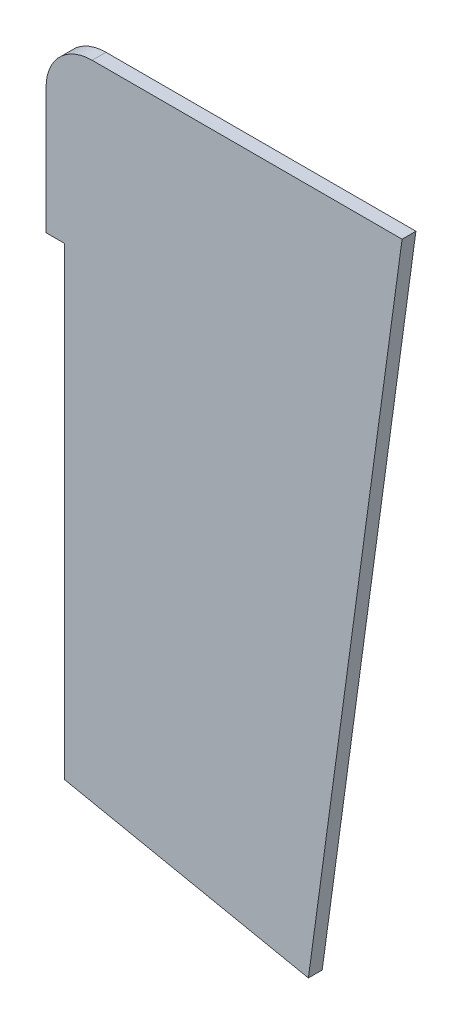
ISO-10303-21;
HEADER;
FILE_DESCRIPTION(('STEP AP214'),'2;1');
FILE_NAME('part.step','',(''),(''),'','','');
FILE_SCHEMA(('AUTOMOTIVE_DESIGN { 1 0 10303 214 1 1 1 1 }'));
ENDSEC;
DATA;
#1=APPLICATION_CONTEXT('core data for automotive mechanical design processes');
#2=APPLICATION_PROTOCOL_DEFINITION('international standard','automotive_design',2000,#1);
#3=PRODUCT_CONTEXT('',#1,'mechanical');
#4=PRODUCT('Part','Part','',(#3));
#5=PRODUCT_RELATED_PRODUCT_CATEGORY('part','',(#4));
#6=PRODUCT_DEFINITION_FORMATION('','',#4);
#7=PRODUCT_DEFINITION_CONTEXT('part definition',#1,'design');
#8=PRODUCT_DEFINITION('design','',#6,#7);
#9=PRODUCT_DEFINITION_SHAPE('','',#8);
#10=(LENGTH_UNIT() NAMED_UNIT(*) SI_UNIT(.MILLI.,.METRE.));
#11=(NAMED_UNIT(*) PLANE_ANGLE_UNIT() SI_UNIT($,.RADIAN.));
#12=(NAMED_UNIT(*) SI_UNIT($,.STERADIAN.) SOLID_ANGLE_UNIT());
#13=UNCERTAINTY_MEASURE_WITH_UNIT(LENGTH_MEASURE(1.E-05),#10,'distance_accuracy_value','');
#14=(GEOMETRIC_REPRESENTATION_CONTEXT(3) GLOBAL_UNCERTAINTY_ASSIGNED_CONTEXT((#13)) GLOBAL_UNIT_ASSIGNED_CONTEXT((#10,
#11,#12)) REPRESENTATION_CONTEXT('',''));
#15=CARTESIAN_POINT('',(0.,0.,0.));
#16=DIRECTION('',(0.,0.,1.));
#17=DIRECTION('',(1.,0.,0.));
#18=AXIS2_PLACEMENT_3D('',#15,#16,#17);
#19=CARTESIAN_POINT('',(236.744667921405,297.979893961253,-3.));
#20=DIRECTION('',(-0.200467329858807,-0.979700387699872,0.));
#21=DIRECTION('',(0.979700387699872,-0.200467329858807,0.));
#22=AXIS2_PLACEMENT_3D('',#19,#20,#21);
#23=PLANE('',#22);
#24=DIRECTION('',(0.979700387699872,-0.200467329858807,0.));
#25=VECTOR('',#24,1.);
#26=CARTESIAN_POINT('',(236.744667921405,297.979893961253,0.));
#27=LINE('',#26,#25);
#28=CARTESIAN_POINT('',(183.797265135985,308.814047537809,0.));
#29=VERTEX_POINT('',#28);
#30=CARTESIAN_POINT('',(236.744667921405,297.979893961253,0.));
#31=VERTEX_POINT('',#30);
#32=EDGE_CURVE('E121',#29,#31,#27,.T.);
#33=ORIENTED_EDGE('',*,*,#32,.F.);
#34=DIRECTION('',(0.,0.,-1.));
#35=VECTOR('',#34,1.);
#36=CARTESIAN_POINT('',(183.797265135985,308.814047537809,-3.));
#37=LINE('',#36,#35);
#38=CARTESIAN_POINT('',(183.797265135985,308.814047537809,-3.));
#39=VERTEX_POINT('',#38);
#40=EDGE_CURVE('E47',#29,#39,#37,.T.);
#41=ORIENTED_EDGE('',*,*,#40,.T.);
#42=DIRECTION('',(0.979700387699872,-0.200467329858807,0.));
#43=VECTOR('',#42,1.);
#44=CARTESIAN_POINT('',(236.744667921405,297.979893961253,-3.));
#45=LINE('',#44,#43);
#46=CARTESIAN_POINT('',(236.744667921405,297.979893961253,-3.));
#47=VERTEX_POINT('',#46);
#48=EDGE_CURVE('E126',#39,#47,#45,.T.);
#49=ORIENTED_EDGE('',*,*,#48,.T.);
#50=DIRECTION('',(0.,0.,1.));
#51=VECTOR('',#50,1.);
#52=CARTESIAN_POINT('',(236.744667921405,297.979893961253,-3.));
#53=LINE('',#52,#51);
#54=EDGE_CURVE('E136',#47,#31,#53,.T.);
#55=ORIENTED_EDGE('',*,*,#54,.T.);
#56=EDGE_LOOP('',(#33,#41,#49,#55));
#57=FACE_BOUND('',#56,.T.);
#58=ADVANCED_FACE('F33',(#57),#23,.T.);
#59=CARTESIAN_POINT('',(257.090292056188,447.074042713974,-3.));
#60=DIRECTION('',(0.990817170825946,-0.135208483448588,0.));
#61=DIRECTION('',(0.135208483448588,0.990817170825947,0.));
#62=AXIS2_PLACEMENT_3D('',#59,#60,#61);
#63=PLANE('',#62);
#64=DIRECTION('',(0.135208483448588,0.990817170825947,0.));
#65=VECTOR('',#64,1.);
#66=CARTESIAN_POINT('',(257.090292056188,447.074042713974,0.));
#67=LINE('',#66,#65);
#68=CARTESIAN_POINT('',(257.090292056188,447.074042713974,0.));
#69=VERTEX_POINT('',#68);
#70=EDGE_CURVE('E116',#31,#69,#67,.T.);
#71=ORIENTED_EDGE('',*,*,#70,.F.);
#72=ORIENTED_EDGE('',*,*,#54,.F.);
#73=DIRECTION('',(0.135208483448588,0.990817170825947,0.));
#74=VECTOR('',#73,1.);
#75=CARTESIAN_POINT('',(257.090292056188,447.074042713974,-3.));
#76=LINE('',#75,#74);
#77=CARTESIAN_POINT('',(257.090292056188,447.074042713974,-3.));
#78=VERTEX_POINT('',#77);
#79=EDGE_CURVE('E117',#47,#78,#76,.T.);
#80=ORIENTED_EDGE('',*,*,#79,.T.);
#81=DIRECTION('',(0.,0.,1.));
#82=VECTOR('',#81,1.);
#83=CARTESIAN_POINT('',(257.090292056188,447.074042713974,-3.));
#84=LINE('',#83,#82);
#85=EDGE_CURVE('E128',#78,#69,#84,.T.);
#86=ORIENTED_EDGE('',*,*,#85,.T.);
#87=EDGE_LOOP('',(#71,#72,#80,#86));
#88=FACE_BOUND('',#87,.T.);
#89=ADVANCED_FACE('F161',(#88),#63,.T.);
#90=CARTESIAN_POINT('',(179.797265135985,309.632531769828,-3.));
#91=DIRECTION('',(-1.,0.,0.));
#92=DIRECTION('',(0.,0.,1.));
#93=AXIS2_PLACEMENT_3D('',#90,#91,#92);
#94=PLANE('',#93);
#95=DIRECTION('',(0.,0.,-1.));
#96=VECTOR('',#95,1.);
#97=CARTESIAN_POINT('',(179.797265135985,409.632531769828,-2.99999999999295));
#98=LINE('',#97,#96);
#99=CARTESIAN_POINT('',(179.797265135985,409.632531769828,0.));
#100=VERTEX_POINT('',#99);
#101=CARTESIAN_POINT('',(179.797265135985,409.632531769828,-2.99999999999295));
#102=VERTEX_POINT('',#101);
#103=EDGE_CURVE('E104',#100,#102,#98,.T.);
#104=ORIENTED_EDGE('',*,*,#103,.F.);
#105=DIRECTION('',(0.,-1.,0.));
#106=VECTOR('',#105,1.);
#107=CARTESIAN_POINT('',(179.797265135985,309.632531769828,0.));
#108=LINE('',#107,#106);
#109=CARTESIAN_POINT('',(179.797265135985,437.074042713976,0.));
#110=VERTEX_POINT('',#109);
#111=EDGE_CURVE('E108',#110,#100,#108,.T.);
#112=ORIENTED_EDGE('',*,*,#111,.F.);
#113=DIRECTION('',(0.,0.,1.));
#114=VECTOR('',#113,1.);
#115=CARTESIAN_POINT('',(179.797265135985,437.074042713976,-3.));
#116=LINE('',#115,#114);
#117=CARTESIAN_POINT('',(179.797265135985,437.074042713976,-3.));
#118=VERTEX_POINT('',#117);
#119=EDGE_CURVE('E55',#110,#118,#116,.F.);
#120=ORIENTED_EDGE('',*,*,#119,.T.);
#121=DIRECTION('',(0.,-1.,0.));
#122=VECTOR('',#121,1.);
#123=CARTESIAN_POINT('',(179.797265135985,309.632531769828,-3.));
#124=LINE('',#123,#122);
#125=EDGE_CURVE('E124',#118,#102,#124,.T.);
#126=ORIENTED_EDGE('',*,*,#125,.T.);
#127=EDGE_LOOP('',(#104,#112,#120,#126));
#128=FACE_BOUND('',#127,.T.);
#129=ADVANCED_FACE('F155',(#128),#94,.T.);
#130=CARTESIAN_POINT('',(179.797265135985,447.074042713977,-3.));
#131=DIRECTION('',(0.,1.,0.));
#132=DIRECTION('',(-1.,0.,0.));
#133=AXIS2_PLACEMENT_3D('',#130,#131,#132);
#134=PLANE('',#133);
#135=DIRECTION('',(-1.,0.,0.));
#136=VECTOR('',#135,1.);
#137=CARTESIAN_POINT('',(179.797265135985,447.074042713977,-3.));
#138=LINE('',#137,#136);
#139=CARTESIAN_POINT('',(189.797265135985,447.074042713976,-3.));
#140=VERTEX_POINT('',#139);
#141=EDGE_CURVE('E120',#78,#140,#138,.T.);
#142=ORIENTED_EDGE('',*,*,#141,.T.);
#143=DIRECTION('',(0.,0.,1.));
#144=VECTOR('',#143,1.);
#145=CARTESIAN_POINT('',(189.797265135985,447.074042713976,-3.));
#146=LINE('',#145,#144);
#147=CARTESIAN_POINT('',(189.797265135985,447.074042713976,0.));
#148=VERTEX_POINT('',#147);
#149=EDGE_CURVE('E139',#140,#148,#146,.T.);
#150=ORIENTED_EDGE('',*,*,#149,.T.);
#151=DIRECTION('',(-1.,0.,0.));
#152=VECTOR('',#151,1.);
#153=CARTESIAN_POINT('',(179.797265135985,447.074042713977,0.));
#154=LINE('',#153,#152);
#155=EDGE_CURVE('E131',#69,#148,#154,.T.);
#156=ORIENTED_EDGE('',*,*,#155,.F.);
#157=ORIENTED_EDGE('',*,*,#85,.F.);
#158=EDGE_LOOP('',(#142,#150,#156,#157));
#159=FACE_BOUND('',#158,.T.);
#160=ADVANCED_FACE('F153',(#159),#134,.T.);
#161=CARTESIAN_POINT('',(0.,0.,-3.));
#162=DIRECTION('',(0.,0.,-1.));
#163=DIRECTION('',(-1.,0.,0.));
#164=AXIS2_PLACEMENT_3D('',#161,#162,#163);
#165=PLANE('',#164);
#166=DIRECTION('',(-1.,0.,0.));
#167=VECTOR('',#166,1.);
#168=CARTESIAN_POINT('',(183.797265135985,409.632531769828,-2.99999999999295));
#169=LINE('',#168,#167);
#170=CARTESIAN_POINT('',(183.797265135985,409.632531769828,-2.99999999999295));
#171=VERTEX_POINT('',#170);
#172=EDGE_CURVE('E103',#171,#102,#169,.T.);
#173=ORIENTED_EDGE('',*,*,#172,.T.);
#174=ORIENTED_EDGE('',*,*,#125,.F.);
#175=CARTESIAN_POINT('',(189.797265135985,437.074042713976,-3.));
#176=DIRECTION('',(0.,0.,-1.));
#177=DIRECTION('',(-1.,0.,0.));
#178=AXIS2_PLACEMENT_3D('',#175,#176,#177);
#179=CIRCLE('',#178,10.);
#180=EDGE_CURVE('E41',#118,#140,#179,.T.);
#181=ORIENTED_EDGE('',*,*,#180,.T.);
#182=ORIENTED_EDGE('',*,*,#141,.F.);
#183=ORIENTED_EDGE('',*,*,#79,.F.);
#184=ORIENTED_EDGE('',*,*,#48,.F.);
#185=DIRECTION('',(0.,1.,0.));
#186=VECTOR('',#185,1.);
#187=CARTESIAN_POINT('',(183.797265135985,0.,-3.));
#188=LINE('',#187,#186);
#189=EDGE_CURVE('E114',#39,#171,#188,.T.);
#190=ORIENTED_EDGE('',*,*,#189,.T.);
#191=EDGE_LOOP('',(#173,#174,#181,#182,#183,#184,#190));
#192=FACE_BOUND('',#191,.T.);
#193=ADVANCED_FACE('F148',(#192),#165,.T.);
#194=CARTESIAN_POINT('',(0.,0.,0.));
#195=DIRECTION('',(0.,0.,-1.));
#196=DIRECTION('',(-1.,0.,0.));
#197=AXIS2_PLACEMENT_3D('',#194,#195,#196);
#198=PLANE('',#197);
#199=ORIENTED_EDGE('',*,*,#111,.T.);
#200=DIRECTION('',(-1.,0.,0.));
#201=VECTOR('',#200,1.);
#202=CARTESIAN_POINT('',(183.797265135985,409.632531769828,0.));
#203=LINE('',#202,#201);
#204=CARTESIAN_POINT('',(183.797265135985,409.632531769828,0.));
#205=VERTEX_POINT('',#204);
#206=EDGE_CURVE('E100',#205,#100,#203,.T.);
#207=ORIENTED_EDGE('',*,*,#206,.F.);
#208=DIRECTION('',(0.,1.,0.));
#209=VECTOR('',#208,1.);
#210=CARTESIAN_POINT('',(183.797265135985,0.,0.));
#211=LINE('',#210,#209);
#212=EDGE_CURVE('E11',#29,#205,#211,.T.);
#213=ORIENTED_EDGE('',*,*,#212,.F.);
#214=ORIENTED_EDGE('',*,*,#32,.T.);
#215=ORIENTED_EDGE('',*,*,#70,.T.);
#216=ORIENTED_EDGE('',*,*,#155,.T.);
#217=CARTESIAN_POINT('',(189.797265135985,437.074042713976,0.));
#218=DIRECTION('',(0.,0.,-1.));
#219=DIRECTION('',(-1.,0.,0.));
#220=AXIS2_PLACEMENT_3D('',#217,#218,#219);
#221=CIRCLE('',#220,10.);
#222=EDGE_CURVE('E143',#148,#110,#221,.F.);
#223=ORIENTED_EDGE('',*,*,#222,.T.);
#224=EDGE_LOOP('',(#199,#207,#213,#214,#215,#216,#223));
#225=FACE_BOUND('',#224,.T.);
#226=ADVANCED_FACE('F107',(#225),#198,.F.);
#227=CARTESIAN_POINT('',(189.797265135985,437.074042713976,-3.));
#228=DIRECTION('',(0.,0.,1.));
#229=DIRECTION('',(1.,0.,0.));
#230=AXIS2_PLACEMENT_3D('',#227,#228,#229);
#231=CYLINDRICAL_SURFACE('',#230,10.);
#232=ORIENTED_EDGE('',*,*,#180,.F.);
#233=ORIENTED_EDGE('',*,*,#119,.F.);
#234=ORIENTED_EDGE('',*,*,#222,.F.);
#235=ORIENTED_EDGE('',*,*,#149,.F.);
#236=EDGE_LOOP('',(#232,#233,#234,#235));
#237=FACE_BOUND('',#236,.T.);
#238=ADVANCED_FACE('F35',(#237),#231,.T.);
#239=CARTESIAN_POINT('',(183.797265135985,409.632531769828,-2.99999999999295));
#240=DIRECTION('',(0.,1.,0.));
#241=DIRECTION('',(0.,0.,1.));
#242=AXIS2_PLACEMENT_3D('',#239,#240,#241);
#243=PLANE('',#242);
#244=ORIENTED_EDGE('',*,*,#103,.T.);
#245=ORIENTED_EDGE('',*,*,#172,.F.);
#246=DIRECTION('',(0.,0.,-1.));
#247=VECTOR('',#246,1.);
#248=CARTESIAN_POINT('',(183.797265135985,409.632531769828,-2.99999999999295));
#249=LINE('',#248,#247);
#250=EDGE_CURVE('E93',#205,#171,#249,.T.);
#251=ORIENTED_EDGE('',*,*,#250,.F.);
#252=ORIENTED_EDGE('',*,*,#206,.T.);
#253=EDGE_LOOP('',(#244,#245,#251,#252));
#254=FACE_BOUND('',#253,.T.);
#255=ADVANCED_FACE('F99',(#254),#243,.F.);
#256=CARTESIAN_POINT('',(183.797265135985,0.,0.));
#257=DIRECTION('',(-1.,0.,0.));
#258=DIRECTION('',(0.,0.,1.));
#259=AXIS2_PLACEMENT_3D('',#256,#257,#258);
#260=PLANE('',#259);
#261=ORIENTED_EDGE('',*,*,#40,.F.);
#262=ORIENTED_EDGE('',*,*,#212,.T.);
#263=ORIENTED_EDGE('',*,*,#250,.T.);
#264=ORIENTED_EDGE('',*,*,#189,.F.);
#265=EDGE_LOOP('',(#261,#262,#263,#264));
#266=FACE_BOUND('',#265,.T.);
#267=ADVANCED_FACE('F92',(#266),#260,.T.);
#268=CLOSED_SHELL('',(#58,#89,#129,#160,#193,#226,#238,#255,#267));
#269=MANIFOLD_SOLID_BREP('B2',#268);
#270=ADVANCED_BREP_SHAPE_REPRESENTATION('',(#18,#269),#14);
#271=SHAPE_DEFINITION_REPRESENTATION(#9,#270);
ENDSEC;
END-ISO-10303-21;
